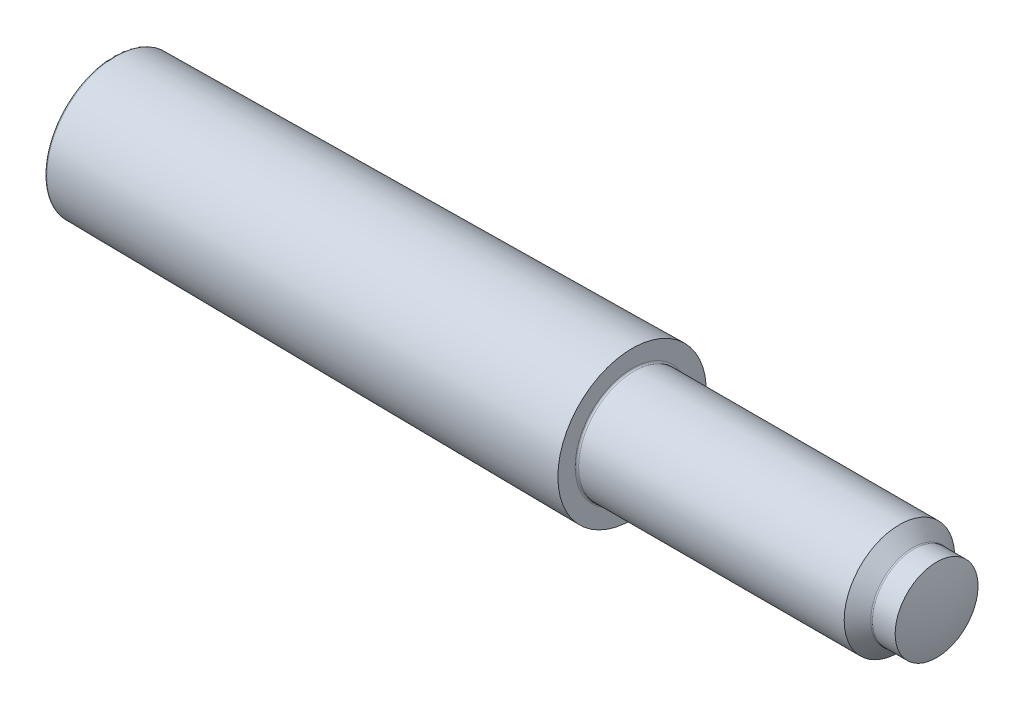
ISO-10303-21;
HEADER;
FILE_DESCRIPTION(('STEP AP214'),'2;1');
FILE_NAME('part.step','',(''),(''),'','','');
FILE_SCHEMA(('AUTOMOTIVE_DESIGN { 1 0 10303 214 1 1 1 1 }'));
ENDSEC;
DATA;
#1=APPLICATION_CONTEXT('core data for automotive mechanical design processes');
#2=APPLICATION_PROTOCOL_DEFINITION('international standard','automotive_design',2000,#1);
#3=PRODUCT_CONTEXT('',#1,'mechanical');
#4=PRODUCT('Part','Part','',(#3));
#5=PRODUCT_RELATED_PRODUCT_CATEGORY('part','',(#4));
#6=PRODUCT_DEFINITION_FORMATION('','',#4);
#7=PRODUCT_DEFINITION_CONTEXT('part definition',#1,'design');
#8=PRODUCT_DEFINITION('design','',#6,#7);
#9=PRODUCT_DEFINITION_SHAPE('','',#8);
#10=(LENGTH_UNIT() NAMED_UNIT(*) SI_UNIT(.MILLI.,.METRE.));
#11=(NAMED_UNIT(*) PLANE_ANGLE_UNIT() SI_UNIT($,.RADIAN.));
#12=(NAMED_UNIT(*) SI_UNIT($,.STERADIAN.) SOLID_ANGLE_UNIT());
#13=UNCERTAINTY_MEASURE_WITH_UNIT(LENGTH_MEASURE(1.E-05),#10,'distance_accuracy_value','');
#14=(GEOMETRIC_REPRESENTATION_CONTEXT(3) GLOBAL_UNCERTAINTY_ASSIGNED_CONTEXT((#13)) GLOBAL_UNIT_ASSIGNED_CONTEXT((#10,
#11,#12)) REPRESENTATION_CONTEXT('',''));
#15=CARTESIAN_POINT('',(0.,0.,0.));
#16=DIRECTION('',(0.,0.,1.));
#17=DIRECTION('',(1.,0.,0.));
#18=AXIS2_PLACEMENT_3D('',#15,#16,#17);
#19=CARTESIAN_POINT('',(100.,0.,0.));
#20=DIRECTION('',(-1.,0.,0.));
#21=DIRECTION('',(0.,1.,0.));
#22=AXIS2_PLACEMENT_3D('',#19,#20,#21);
#23=SPHERICAL_SURFACE('',#22,20.);
#24=CARTESIAN_POINT('',(119.078784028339,0.,0.));
#25=DIRECTION('',(-1.,0.,0.));
#26=DIRECTION('',(0.,0.,1.));
#27=AXIS2_PLACEMENT_3D('',#24,#25,#26);
#28=CIRCLE('',#27,6.);
#29=CARTESIAN_POINT('',(119.078784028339,0.,6.));
#30=VERTEX_POINT('',#29);
#31=EDGE_CURVE('E58',#30,#30,#28,.T.);
#32=ORIENTED_EDGE('',*,*,#31,.F.);
#33=EDGE_LOOP('',(#32));
#34=FACE_BOUND('',#33,.T.);
#35=ADVANCED_FACE('F32',(#34),#23,.T.);
#36=CARTESIAN_POINT('',(-8.74032159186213,0.,0.));
#37=DIRECTION('',(-1.,0.,0.));
#38=DIRECTION('',(0.,0.,1.));
#39=AXIS2_PLACEMENT_3D('',#36,#37,#38);
#40=CYLINDRICAL_SURFACE('',#39,6.);
#41=CARTESIAN_POINT('',(115.803553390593,0.,0.));
#42=DIRECTION('',(-1.,0.,0.));
#43=DIRECTION('',(0.,0.,1.));
#44=AXIS2_PLACEMENT_3D('',#41,#42,#43);
#45=CIRCLE('',#44,6.);
#46=CARTESIAN_POINT('',(115.803553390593,0.,6.));
#47=VERTEX_POINT('',#46);
#48=EDGE_CURVE('E10',#47,#47,#45,.F.);
#49=ORIENTED_EDGE('',*,*,#48,.T.);
#50=EDGE_LOOP('',(#49));
#51=FACE_BOUND('',#50,.T.);
#52=ORIENTED_EDGE('',*,*,#31,.T.);
#53=EDGE_LOOP('',(#52));
#54=FACE_BOUND('',#53,.T.);
#55=ADVANCED_FACE('F86',(#51,#54),#40,.T.);
#56=CARTESIAN_POINT('',(115.7,0.,0.));
#57=DIRECTION('',(-1.,0.,0.));
#58=DIRECTION('',(0.,0.,1.));
#59=AXIS2_PLACEMENT_3D('',#56,#57,#58);
#60=CONICAL_SURFACE('',#59,6.,0.785398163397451);
#61=CARTESIAN_POINT('',(115.626776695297,0.,0.));
#62=DIRECTION('',(-1.,0.,0.));
#63=DIRECTION('',(0.,0.,1.));
#64=AXIS2_PLACEMENT_3D('',#61,#62,#63);
#65=CIRCLE('',#64,6.07322330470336);
#66=CARTESIAN_POINT('',(115.626776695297,0.,6.07322330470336));
#67=VERTEX_POINT('',#66);
#68=EDGE_CURVE('E39',#67,#67,#65,.T.);
#69=ORIENTED_EDGE('',*,*,#68,.T.);
#70=EDGE_LOOP('',(#69));
#71=FACE_BOUND('',#70,.T.);
#72=CARTESIAN_POINT('',(113.7,0.,0.));
#73=DIRECTION('',(-1.,0.,0.));
#74=DIRECTION('',(0.,0.,1.));
#75=AXIS2_PLACEMENT_3D('',#72,#73,#74);
#76=CIRCLE('',#75,8.);
#77=CARTESIAN_POINT('',(113.7,0.,8.));
#78=VERTEX_POINT('',#77);
#79=EDGE_CURVE('E61',#78,#78,#76,.T.);
#80=ORIENTED_EDGE('',*,*,#79,.F.);
#81=EDGE_LOOP('',(#80));
#82=FACE_BOUND('',#81,.T.);
#83=ADVANCED_FACE('F82',(#71,#82),#60,.T.);
#84=CARTESIAN_POINT('',(-8.74032159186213,0.,0.));
#85=DIRECTION('',(-1.,0.,0.));
#86=DIRECTION('',(0.,0.,1.));
#87=AXIS2_PLACEMENT_3D('',#84,#85,#86);
#88=CYLINDRICAL_SURFACE('',#87,8.);
#89=CARTESIAN_POINT('',(75.25,0.,0.));
#90=DIRECTION('',(-1.,0.,0.));
#91=DIRECTION('',(0.,0.,1.));
#92=AXIS2_PLACEMENT_3D('',#89,#90,#91);
#93=CIRCLE('',#92,8.);
#94=CARTESIAN_POINT('',(75.25,0.,8.));
#95=VERTEX_POINT('',#94);
#96=EDGE_CURVE('E43',#95,#95,#93,.F.);
#97=ORIENTED_EDGE('',*,*,#96,.T.);
#98=EDGE_LOOP('',(#97));
#99=FACE_BOUND('',#98,.T.);
#100=ORIENTED_EDGE('',*,*,#79,.T.);
#101=EDGE_LOOP('',(#100));
#102=FACE_BOUND('',#101,.T.);
#103=ADVANCED_FACE('F72',(#99,#102),#88,.T.);
#104=CARTESIAN_POINT('',(75.,10.7499999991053,0.));
#105=DIRECTION('',(-1.,0.,0.));
#106=DIRECTION('',(0.,0.,1.));
#107=AXIS2_PLACEMENT_3D('',#104,#105,#106);
#108=PLANE('',#107);
#109=CARTESIAN_POINT('',(75.,0.,0.));
#110=DIRECTION('',(-1.,0.,0.));
#111=DIRECTION('',(0.,0.,1.));
#112=AXIS2_PLACEMENT_3D('',#109,#110,#111);
#113=CIRCLE('',#112,8.25);
#114=CARTESIAN_POINT('',(75.,0.,8.25));
#115=VERTEX_POINT('',#114);
#116=EDGE_CURVE('E47',#115,#115,#113,.T.);
#117=ORIENTED_EDGE('',*,*,#116,.T.);
#118=EDGE_LOOP('',(#117));
#119=FACE_BOUND('',#118,.T.);
#120=CARTESIAN_POINT('',(75.,0.,0.));
#121=DIRECTION('',(-1.,0.,0.));
#122=DIRECTION('',(0.,0.,1.));
#123=AXIS2_PLACEMENT_3D('',#120,#121,#122);
#124=CIRCLE('',#123,10.7499999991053);
#125=CARTESIAN_POINT('',(75.,0.,10.7499999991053));
#126=VERTEX_POINT('',#125);
#127=EDGE_CURVE('E64',#126,#126,#124,.T.);
#128=ORIENTED_EDGE('',*,*,#127,.F.);
#129=EDGE_LOOP('',(#128));
#130=FACE_BOUND('',#129,.T.);
#131=ADVANCED_FACE('F70',(#119,#130),#108,.F.);
#132=CARTESIAN_POINT('',(75.,0.,0.));
#133=DIRECTION('',(1.,0.,0.));
#134=DIRECTION('',(0.,0.,-1.));
#135=AXIS2_PLACEMENT_3D('',#132,#133,#134);
#136=CONICAL_SURFACE('',#135,10.7499999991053,0.00999966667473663);
#137=CARTESIAN_POINT('',(0.247500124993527,0.,0.));
#138=DIRECTION('',(-1.,0.,0.));
#139=DIRECTION('',(0.,0.,1.));
#140=AXIS2_PLACEMENT_3D('',#137,#138,#139);
#141=CIRCLE('',#140,10.002475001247);
#142=CARTESIAN_POINT('',(0.247500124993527,0.,10.002475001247));
#143=VERTEX_POINT('',#142);
#144=EDGE_CURVE('E52',#143,#143,#141,.F.);
#145=ORIENTED_EDGE('',*,*,#144,.T.);
#146=EDGE_LOOP('',(#145));
#147=FACE_BOUND('',#146,.T.);
#148=ORIENTED_EDGE('',*,*,#127,.T.);
#149=EDGE_LOOP('',(#148));
#150=FACE_BOUND('',#149,.T.);
#151=ADVANCED_FACE('F68',(#147,#150),#136,.T.);
#152=CARTESIAN_POINT('',(0.,0.,0.));
#153=DIRECTION('',(1.,0.,0.));
#154=DIRECTION('',(0.,0.,-1.));
#155=AXIS2_PLACEMENT_3D('',#152,#153,#154);
#156=PLANE('',#155);
#157=CARTESIAN_POINT('',(0.,0.,0.));
#158=DIRECTION('',(1.,0.,0.));
#159=DIRECTION('',(0.,0.,-1.));
#160=AXIS2_PLACEMENT_3D('',#157,#158,#159);
#161=CIRCLE('',#160,9.75248750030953);
#162=CARTESIAN_POINT('',(0.,0.,-9.75248750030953));
#163=VERTEX_POINT('',#162);
#164=EDGE_CURVE('E55',#163,#163,#161,.F.);
#165=ORIENTED_EDGE('',*,*,#164,.T.);
#166=EDGE_LOOP('',(#165));
#167=FACE_BOUND('',#166,.T.);
#168=ADVANCED_FACE('F79',(#167),#156,.F.);
#169=CARTESIAN_POINT('',(0.25,0.,0.));
#170=DIRECTION('',(1.,0.,0.));
#171=DIRECTION('',(0.,0.,-1.));
#172=AXIS2_PLACEMENT_3D('',#169,#170,#171);
#173=TOROIDAL_SURFACE('',#172,9.75248750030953,0.25);
#174=ORIENTED_EDGE('',*,*,#144,.F.);
#175=EDGE_LOOP('',(#174));
#176=FACE_BOUND('',#175,.T.);
#177=ORIENTED_EDGE('',*,*,#164,.F.);
#178=EDGE_LOOP('',(#177));
#179=FACE_BOUND('',#178,.T.);
#180=ADVANCED_FACE('F96',(#176,#179),#173,.T.);
#181=CARTESIAN_POINT('',(75.25,0.,0.));
#182=DIRECTION('',(-1.,0.,0.));
#183=DIRECTION('',(0.,0.,1.));
#184=AXIS2_PLACEMENT_3D('',#181,#182,#183);
#185=TOROIDAL_SURFACE('',#184,8.25,0.25);
#186=ORIENTED_EDGE('',*,*,#96,.F.);
#187=EDGE_LOOP('',(#186));
#188=FACE_BOUND('',#187,.T.);
#189=ORIENTED_EDGE('',*,*,#116,.F.);
#190=EDGE_LOOP('',(#189));
#191=FACE_BOUND('',#190,.T.);
#192=ADVANCED_FACE('F98',(#188,#191),#185,.F.);
#193=CARTESIAN_POINT('',(115.803553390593,0.,0.));
#194=DIRECTION('',(-1.,0.,0.));
#195=DIRECTION('',(0.,0.,1.));
#196=AXIS2_PLACEMENT_3D('',#193,#194,#195);
#197=TOROIDAL_SURFACE('',#196,6.25,0.25);
#198=ORIENTED_EDGE('',*,*,#48,.F.);
#199=EDGE_LOOP('',(#198));
#200=FACE_BOUND('',#199,.T.);
#201=ORIENTED_EDGE('',*,*,#68,.F.);
#202=EDGE_LOOP('',(#201));
#203=FACE_BOUND('',#202,.T.);
#204=ADVANCED_FACE('F34',(#200,#203),#197,.F.);
#205=CLOSED_SHELL('',(#35,#55,#83,#103,#131,#151,#168,#180,#192,#204));
#206=MANIFOLD_SOLID_BREP('B2',#205);
#207=ADVANCED_BREP_SHAPE_REPRESENTATION('',(#18,#206),#14);
#208=SHAPE_DEFINITION_REPRESENTATION(#9,#207);
ENDSEC;
END-ISO-10303-21;
